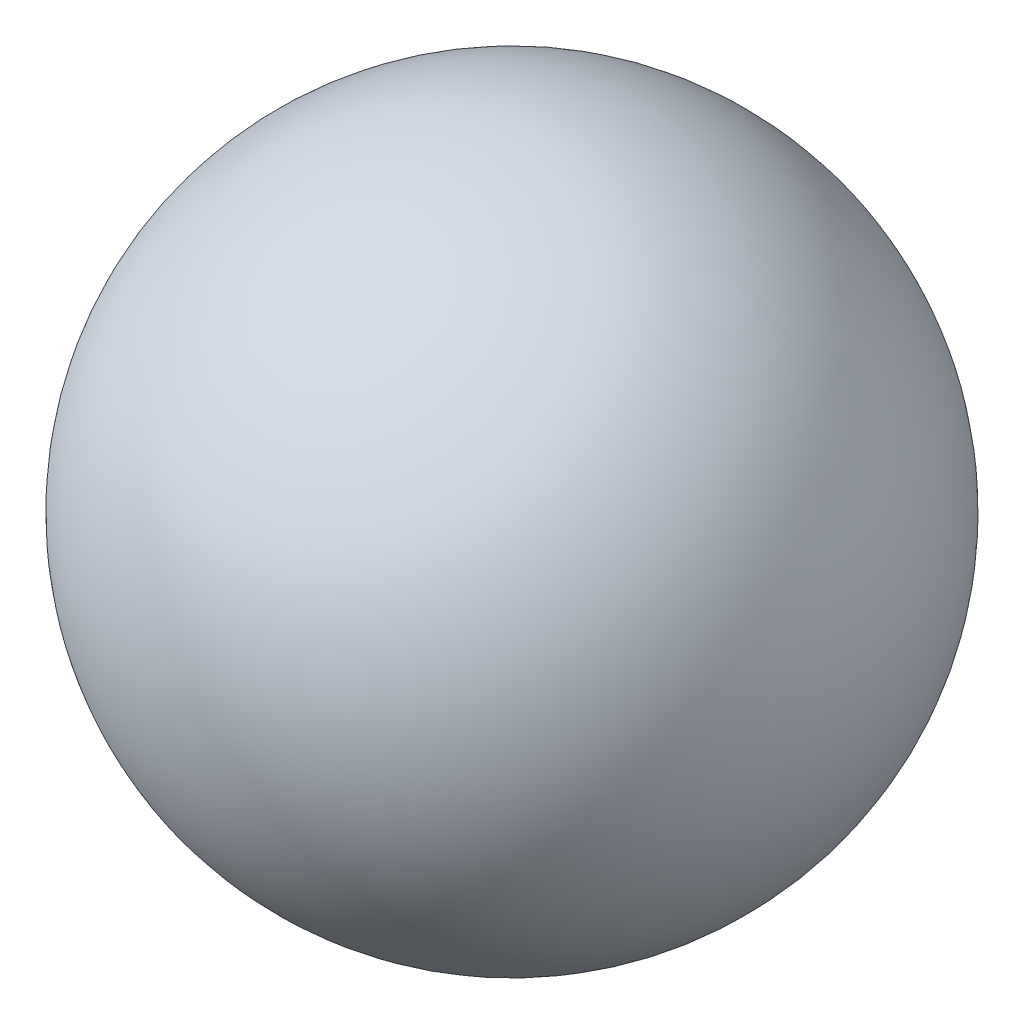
from build123d import *


with BuildPart() as part:
    # Sketch 1 → Revolve 1 (revolve)
    with BuildSketch(Plane(origin=(0, 0, 0), x_dir=(1, 0, 0), z_dir=(0, 1, 0))):
        with BuildLine():
            Line((0, 8.5), (0, -8.5))
            ThreePointArc((0, -8.5), (8.5, 0), (0, 8.5))
        make_face()
    revolve(axis=Axis((0, 0, -31.761524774), (0, 0, 1)))


solid = part.part
